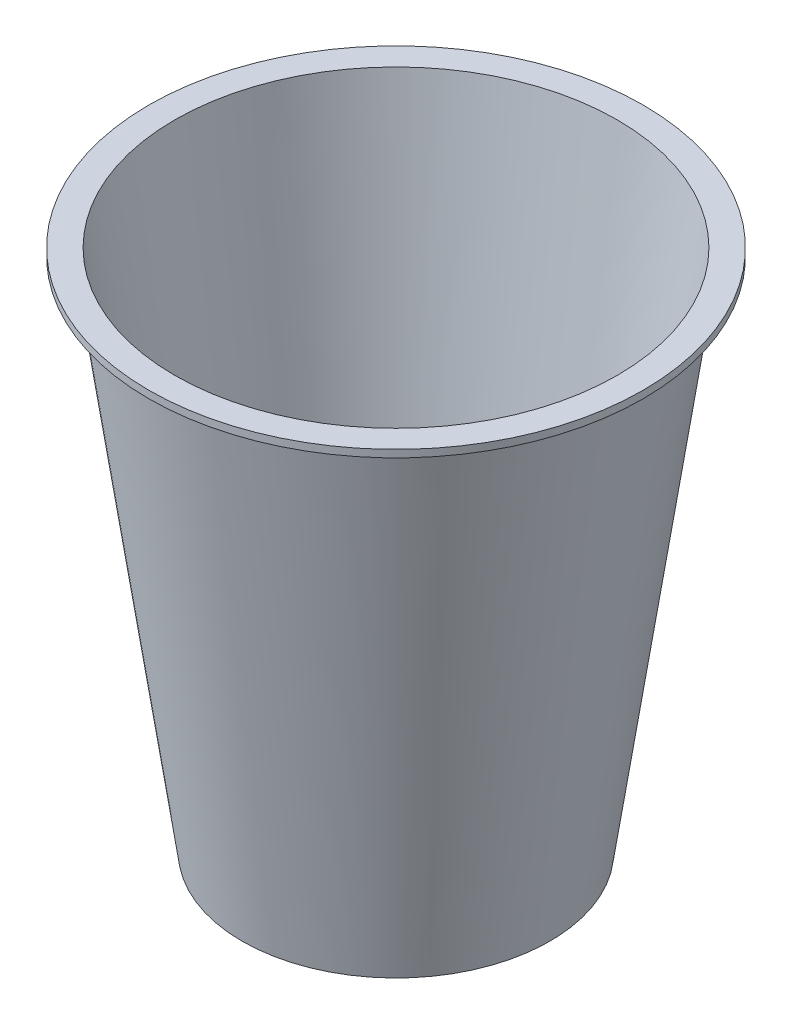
from build123d import *


with BuildPart() as part:
    # Esquisse1 → Base-R_vol.-Mince (revolve)
    with BuildSketch(Plane.XY, mode=Mode.PRIVATE) as base_r_vol_mince_sk:
        Polygon((-33.5, 70), (-30, 70), (-20, 0), (0, 0), (0, -1), (-20.867295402, -1), (-30.867295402, 69), (-33.5, 69), align=None)
    revolve(base_r_vol_mince_sk.sketch.rotate(Axis((0, 0, 0), (0, 1, 0)), 270), axis=Axis((0, 0, 0), (0, 1, 0)))


solid = part.part
